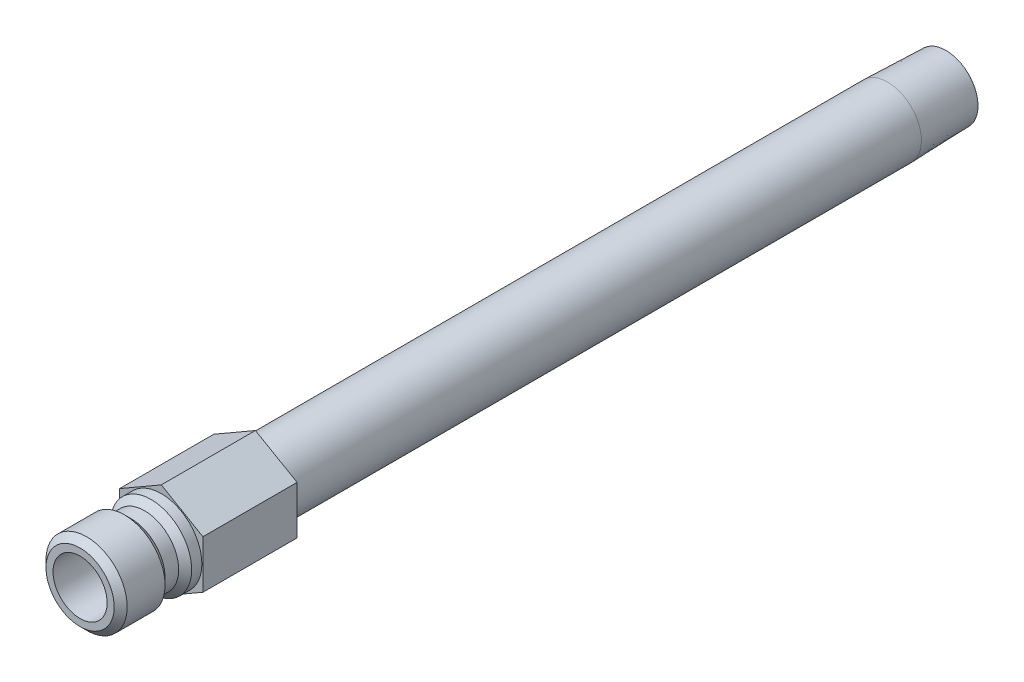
ISO-10303-21;
HEADER;
FILE_DESCRIPTION(('STEP AP214'),'2;1');
FILE_NAME('part.step','',(''),(''),'','','');
FILE_SCHEMA(('AUTOMOTIVE_DESIGN { 1 0 10303 214 1 1 1 1 }'));
ENDSEC;
DATA;
#1=APPLICATION_CONTEXT('core data for automotive mechanical design processes');
#2=APPLICATION_PROTOCOL_DEFINITION('international standard','automotive_design',2000,#1);
#3=PRODUCT_CONTEXT('',#1,'mechanical');
#4=PRODUCT('Part','Part','',(#3));
#5=PRODUCT_RELATED_PRODUCT_CATEGORY('part','',(#4));
#6=PRODUCT_DEFINITION_FORMATION('','',#4);
#7=PRODUCT_DEFINITION_CONTEXT('part definition',#1,'design');
#8=PRODUCT_DEFINITION('design','',#6,#7);
#9=PRODUCT_DEFINITION_SHAPE('','',#8);
#10=(LENGTH_UNIT() NAMED_UNIT(*) SI_UNIT(.MILLI.,.METRE.));
#11=(NAMED_UNIT(*) PLANE_ANGLE_UNIT() SI_UNIT($,.RADIAN.));
#12=(NAMED_UNIT(*) SI_UNIT($,.STERADIAN.) SOLID_ANGLE_UNIT());
#13=UNCERTAINTY_MEASURE_WITH_UNIT(LENGTH_MEASURE(1.E-05),#10,'distance_accuracy_value','');
#14=(GEOMETRIC_REPRESENTATION_CONTEXT(3) GLOBAL_UNCERTAINTY_ASSIGNED_CONTEXT((#13)) GLOBAL_UNIT_ASSIGNED_CONTEXT((#10,
#11,#12)) REPRESENTATION_CONTEXT('',''));
#15=CARTESIAN_POINT('',(0.,0.,0.));
#16=DIRECTION('',(0.,0.,1.));
#17=DIRECTION('',(1.,0.,0.));
#18=AXIS2_PLACEMENT_3D('',#15,#16,#17);
#19=CARTESIAN_POINT('',(0.,0.,0.));
#20=DIRECTION('',(0.,0.,-1.));
#21=DIRECTION('',(0.,1.,0.));
#22=AXIS2_PLACEMENT_3D('',#19,#20,#21);
#23=CYLINDRICAL_SURFACE('',#22,3.175);
#24=CARTESIAN_POINT('',(0.,0.,0.));
#25=DIRECTION('',(0.,0.,1.));
#26=DIRECTION('',(1.,0.,0.));
#27=AXIS2_PLACEMENT_3D('',#24,#25,#26);
#28=CIRCLE('',#27,3.175);
#29=CARTESIAN_POINT('',(3.175,0.,0.));
#30=VERTEX_POINT('',#29);
#31=EDGE_CURVE('E11',#30,#30,#28,.T.);
#32=ORIENTED_EDGE('',*,*,#31,.F.);
#33=EDGE_LOOP('',(#32));
#34=FACE_BOUND('',#33,.T.);
#35=CARTESIAN_POINT('',(0.,0.,9.525));
#36=DIRECTION('',(0.,0.,-1.));
#37=DIRECTION('',(0.,1.,0.));
#38=AXIS2_PLACEMENT_3D('',#35,#36,#37);
#39=CIRCLE('',#38,3.175);
#40=CARTESIAN_POINT('',(0.,3.175,9.525));
#41=VERTEX_POINT('',#40);
#42=EDGE_CURVE('E37',#41,#41,#39,.T.);
#43=ORIENTED_EDGE('',*,*,#42,.F.);
#44=EDGE_LOOP('',(#43));
#45=FACE_BOUND('',#44,.T.);
#46=ADVANCED_FACE('F34',(#34,#45),#23,.F.);
#47=CARTESIAN_POINT('',(0.,3.175,9.525));
#48=DIRECTION('',(0.,0.,1.));
#49=DIRECTION('',(0.,-1.,0.));
#50=AXIS2_PLACEMENT_3D('',#47,#48,#49);
#51=PLANE('',#50);
#52=ORIENTED_EDGE('',*,*,#42,.T.);
#53=EDGE_LOOP('',(#52));
#54=FACE_BOUND('',#53,.T.);
#55=CARTESIAN_POINT('',(0.,0.,9.525));
#56=DIRECTION('',(0.,0.,-1.));
#57=DIRECTION('',(0.,1.,0.));
#58=AXIS2_PLACEMENT_3D('',#55,#56,#57);
#59=CIRCLE('',#58,4.0005);
#60=CARTESIAN_POINT('',(0.,4.0005,9.525));
#61=VERTEX_POINT('',#60);
#62=EDGE_CURVE('E174',#61,#61,#59,.T.);
#63=ORIENTED_EDGE('',*,*,#62,.F.);
#64=EDGE_LOOP('',(#63));
#65=FACE_BOUND('',#64,.T.);
#66=ADVANCED_FACE('F181',(#54,#65),#51,.T.);
#67=CARTESIAN_POINT('',(0.,0.,8.763));
#68=DIRECTION('',(0.,0.,-1.));
#69=DIRECTION('',(0.,1.,0.));
#70=AXIS2_PLACEMENT_3D('',#67,#68,#69);
#71=CONICAL_SURFACE('',#70,4.7625,0.785398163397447);
#72=ORIENTED_EDGE('',*,*,#62,.T.);
#73=EDGE_LOOP('',(#72));
#74=FACE_BOUND('',#73,.T.);
#75=CARTESIAN_POINT('',(0.,0.,8.763));
#76=DIRECTION('',(0.,0.,-1.));
#77=DIRECTION('',(0.,1.,0.));
#78=AXIS2_PLACEMENT_3D('',#75,#76,#77);
#79=CIRCLE('',#78,4.7625);
#80=CARTESIAN_POINT('',(0.,4.7625,8.763));
#81=VERTEX_POINT('',#80);
#82=EDGE_CURVE('E172',#81,#81,#79,.T.);
#83=ORIENTED_EDGE('',*,*,#82,.F.);
#84=EDGE_LOOP('',(#83));
#85=FACE_BOUND('',#84,.T.);
#86=ADVANCED_FACE('F189',(#74,#85),#71,.T.);
#87=CARTESIAN_POINT('',(0.,0.,0.));
#88=DIRECTION('',(0.,0.,-1.));
#89=DIRECTION('',(0.,1.,0.));
#90=AXIS2_PLACEMENT_3D('',#87,#88,#89);
#91=CYLINDRICAL_SURFACE('',#90,4.7625);
#92=ORIENTED_EDGE('',*,*,#82,.T.);
#93=EDGE_LOOP('',(#92));
#94=FACE_BOUND('',#93,.T.);
#95=CARTESIAN_POINT('',(0.,0.,4.318));
#96=DIRECTION('',(0.,0.,-1.));
#97=DIRECTION('',(0.,1.,0.));
#98=AXIS2_PLACEMENT_3D('',#95,#96,#97);
#99=CIRCLE('',#98,4.7625);
#100=CARTESIAN_POINT('',(0.,4.7625,4.318));
#101=VERTEX_POINT('',#100);
#102=EDGE_CURVE('E169',#101,#101,#99,.T.);
#103=ORIENTED_EDGE('',*,*,#102,.F.);
#104=EDGE_LOOP('',(#103));
#105=FACE_BOUND('',#104,.T.);
#106=ADVANCED_FACE('F255',(#94,#105),#91,.T.);
#107=CARTESIAN_POINT('',(0.,0.,3.556));
#108=DIRECTION('',(0.,0.,1.));
#109=DIRECTION('',(0.,-1.,0.));
#110=AXIS2_PLACEMENT_3D('',#107,#108,#109);
#111=CONICAL_SURFACE('',#110,4.0005,0.785398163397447);
#112=ORIENTED_EDGE('',*,*,#102,.T.);
#113=EDGE_LOOP('',(#112));
#114=FACE_BOUND('',#113,.T.);
#115=CARTESIAN_POINT('',(0.,0.,3.556));
#116=DIRECTION('',(0.,0.,-1.));
#117=DIRECTION('',(0.,1.,0.));
#118=AXIS2_PLACEMENT_3D('',#115,#116,#117);
#119=CIRCLE('',#118,4.0005);
#120=CARTESIAN_POINT('',(0.,4.0005,3.556));
#121=VERTEX_POINT('',#120);
#122=EDGE_CURVE('E166',#121,#121,#119,.T.);
#123=ORIENTED_EDGE('',*,*,#122,.F.);
#124=EDGE_LOOP('',(#123));
#125=FACE_BOUND('',#124,.T.);
#126=ADVANCED_FACE('F251',(#114,#125),#111,.T.);
#127=CARTESIAN_POINT('',(0.,0.,0.));
#128=DIRECTION('',(0.,0.,-1.));
#129=DIRECTION('',(0.,1.,0.));
#130=AXIS2_PLACEMENT_3D('',#127,#128,#129);
#131=CYLINDRICAL_SURFACE('',#130,4.0005);
#132=ORIENTED_EDGE('',*,*,#122,.T.);
#133=EDGE_LOOP('',(#132));
#134=FACE_BOUND('',#133,.T.);
#135=CARTESIAN_POINT('',(0.,0.,1.9558));
#136=DIRECTION('',(0.,0.,-1.));
#137=DIRECTION('',(0.,1.,0.));
#138=AXIS2_PLACEMENT_3D('',#135,#136,#137);
#139=CIRCLE('',#138,4.0005);
#140=CARTESIAN_POINT('',(0.,4.0005,1.9558));
#141=VERTEX_POINT('',#140);
#142=EDGE_CURVE('E163',#141,#141,#139,.T.);
#143=ORIENTED_EDGE('',*,*,#142,.F.);
#144=EDGE_LOOP('',(#143));
#145=FACE_BOUND('',#144,.T.);
#146=ADVANCED_FACE('F247',(#134,#145),#131,.T.);
#147=CARTESIAN_POINT('',(0.,0.,1.1938));
#148=DIRECTION('',(0.,0.,-1.));
#149=DIRECTION('',(0.,1.,0.));
#150=AXIS2_PLACEMENT_3D('',#147,#148,#149);
#151=CONICAL_SURFACE('',#150,4.7625,0.785398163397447);
#152=ORIENTED_EDGE('',*,*,#142,.T.);
#153=EDGE_LOOP('',(#152));
#154=FACE_BOUND('',#153,.T.);
#155=CARTESIAN_POINT('',(0.,0.,1.1938));
#156=DIRECTION('',(0.,0.,-1.));
#157=DIRECTION('',(0.,1.,0.));
#158=AXIS2_PLACEMENT_3D('',#155,#156,#157);
#159=CIRCLE('',#158,4.7625);
#160=CARTESIAN_POINT('',(0.,4.7625,1.1938));
#161=VERTEX_POINT('',#160);
#162=EDGE_CURVE('E160',#161,#161,#159,.T.);
#163=ORIENTED_EDGE('',*,*,#162,.F.);
#164=EDGE_LOOP('',(#163));
#165=FACE_BOUND('',#164,.T.);
#166=ADVANCED_FACE('F243',(#154,#165),#151,.T.);
#167=CARTESIAN_POINT('',(0.,0.,0.));
#168=DIRECTION('',(0.,0.,-1.));
#169=DIRECTION('',(0.,1.,0.));
#170=AXIS2_PLACEMENT_3D('',#167,#168,#169);
#171=CYLINDRICAL_SURFACE('',#170,4.7625);
#172=ORIENTED_EDGE('',*,*,#162,.T.);
#173=EDGE_LOOP('',(#172));
#174=FACE_BOUND('',#173,.T.);
#175=CARTESIAN_POINT('',(0.,0.,0.));
#176=DIRECTION('',(0.,0.,-1.));
#177=DIRECTION('',(0.,1.,0.));
#178=AXIS2_PLACEMENT_3D('',#175,#176,#177);
#179=CIRCLE('',#178,4.7625);
#180=CARTESIAN_POINT('',(0.,4.7625,0.));
#181=VERTEX_POINT('',#180);
#182=EDGE_CURVE('E157',#181,#181,#179,.T.);
#183=ORIENTED_EDGE('',*,*,#182,.F.);
#184=EDGE_LOOP('',(#183));
#185=FACE_BOUND('',#184,.T.);
#186=ADVANCED_FACE('F196',(#174,#185),#171,.T.);
#187=CARTESIAN_POINT('',(-4.8895,2.82295414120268,0.));
#188=DIRECTION('',(0.,0.,1.));
#189=DIRECTION('',(1.,0.,0.));
#190=AXIS2_PLACEMENT_3D('',#187,#188,#189);
#191=PLANE('',#190);
#192=ORIENTED_EDGE('',*,*,#31,.T.);
#193=EDGE_LOOP('',(#192));
#194=FACE_BOUND('',#193,.T.);
#195=CARTESIAN_POINT('',(0.,0.,0.));
#196=DIRECTION('',(0.,0.,1.));
#197=DIRECTION('',(1.,0.,0.));
#198=AXIS2_PLACEMENT_3D('',#195,#196,#197);
#199=CIRCLE('',#198,2.38124999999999);
#200=CARTESIAN_POINT('',(2.38124999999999,0.,0.));
#201=VERTEX_POINT('',#200);
#202=EDGE_CURVE('E126',#201,#201,#199,.T.);
#203=ORIENTED_EDGE('',*,*,#202,.F.);
#204=EDGE_LOOP('',(#203));
#205=FACE_BOUND('',#204,.T.);
#206=ADVANCED_FACE('F192',(#194,#205),#191,.T.);
#207=CARTESIAN_POINT('',(0.,0.,-92.075));
#208=DIRECTION('',(0.,0.,1.));
#209=DIRECTION('',(0.,-1.,0.));
#210=AXIS2_PLACEMENT_3D('',#207,#208,#209);
#211=CONICAL_SURFACE('',#210,3.75443877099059,0.0312396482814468);
#212=CARTESIAN_POINT('',(0.,0.,-85.217));
#213=DIRECTION('',(0.,0.,-1.));
#214=DIRECTION('',(0.,1.,0.));
#215=AXIS2_PLACEMENT_3D('',#212,#213,#214);
#216=CIRCLE('',#215,3.96874999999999);
#217=CARTESIAN_POINT('',(0.,3.96875,-85.217));
#218=VERTEX_POINT('',#217);
#219=EDGE_CURVE('E154',#218,#218,#216,.T.);
#220=ORIENTED_EDGE('',*,*,#219,.T.);
#221=EDGE_LOOP('',(#220));
#222=FACE_BOUND('',#221,.T.);
#223=CARTESIAN_POINT('',(0.,0.,-92.075));
#224=DIRECTION('',(0.,0.,-1.));
#225=DIRECTION('',(0.,1.,0.));
#226=AXIS2_PLACEMENT_3D('',#223,#224,#225);
#227=CIRCLE('',#226,3.75443877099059);
#228=CARTESIAN_POINT('',(0.,3.7544387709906,-92.075));
#229=VERTEX_POINT('',#228);
#230=EDGE_CURVE('E151',#229,#229,#227,.T.);
#231=ORIENTED_EDGE('',*,*,#230,.F.);
#232=EDGE_LOOP('',(#231));
#233=FACE_BOUND('',#232,.T.);
#234=ADVANCED_FACE('F195',(#222,#233),#211,.T.);
#235=CARTESIAN_POINT('',(0.,0.,0.));
#236=DIRECTION('',(0.,0.,-1.));
#237=DIRECTION('',(0.,1.,0.));
#238=AXIS2_PLACEMENT_3D('',#235,#236,#237);
#239=CYLINDRICAL_SURFACE('',#238,3.96874999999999);
#240=ORIENTED_EDGE('',*,*,#219,.F.);
#241=EDGE_LOOP('',(#240));
#242=FACE_BOUND('',#241,.T.);
#243=CARTESIAN_POINT('',(0.,0.,-11.049));
#244=DIRECTION('',(0.,0.,1.));
#245=DIRECTION('',(1.,0.,0.));
#246=AXIS2_PLACEMENT_3D('',#243,#244,#245);
#247=CIRCLE('',#246,3.96874999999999);
#248=CARTESIAN_POINT('',(3.96874999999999,0.,-11.049));
#249=VERTEX_POINT('',#248);
#250=EDGE_CURVE('E140',#249,#249,#247,.F.);
#251=ORIENTED_EDGE('',*,*,#250,.T.);
#252=EDGE_LOOP('',(#251));
#253=FACE_BOUND('',#252,.T.);
#254=ADVANCED_FACE('F233',(#242,#253),#239,.T.);
#255=CARTESIAN_POINT('',(0.,3.7544387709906,-92.075));
#256=DIRECTION('',(0.,0.,-1.));
#257=DIRECTION('',(0.,1.,0.));
#258=AXIS2_PLACEMENT_3D('',#255,#256,#257);
#259=PLANE('',#258);
#260=ORIENTED_EDGE('',*,*,#230,.T.);
#261=EDGE_LOOP('',(#260));
#262=FACE_BOUND('',#261,.T.);
#263=CARTESIAN_POINT('',(0.,0.,-92.075));
#264=DIRECTION('',(0.,0.,-1.));
#265=DIRECTION('',(0.,1.,0.));
#266=AXIS2_PLACEMENT_3D('',#263,#264,#265);
#267=CIRCLE('',#266,2.38124999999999);
#268=CARTESIAN_POINT('',(0.,2.38125,-92.075));
#269=VERTEX_POINT('',#268);
#270=EDGE_CURVE('E147',#269,#269,#267,.T.);
#271=ORIENTED_EDGE('',*,*,#270,.F.);
#272=EDGE_LOOP('',(#271));
#273=FACE_BOUND('',#272,.T.);
#274=ADVANCED_FACE('F230',(#262,#273),#259,.T.);
#275=CARTESIAN_POINT('',(0.,0.,0.));
#276=DIRECTION('',(0.,0.,-1.));
#277=DIRECTION('',(0.,1.,0.));
#278=AXIS2_PLACEMENT_3D('',#275,#276,#277);
#279=CYLINDRICAL_SURFACE('',#278,2.38124999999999);
#280=ORIENTED_EDGE('',*,*,#202,.T.);
#281=EDGE_LOOP('',(#280));
#282=FACE_BOUND('',#281,.T.);
#283=ORIENTED_EDGE('',*,*,#270,.T.);
#284=EDGE_LOOP('',(#283));
#285=FACE_BOUND('',#284,.T.);
#286=ADVANCED_FACE('F216',(#282,#285),#279,.F.);
#287=CARTESIAN_POINT('',(0.,5.64590828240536,-11.049));
#288=DIRECTION('',(-0.5,0.866025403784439,0.));
#289=DIRECTION('',(-0.866025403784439,-0.5,0.));
#290=AXIS2_PLACEMENT_3D('',#287,#288,#289);
#291=PLANE('',#290);
#292=DIRECTION('',(-0.866025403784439,-0.5,0.));
#293=VECTOR('',#292,1.);
#294=CARTESIAN_POINT('',(0.,5.64590828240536,0.));
#295=LINE('',#294,#293);
#296=CARTESIAN_POINT('',(0.,5.64590828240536,0.));
#297=VERTEX_POINT('',#296);
#298=CARTESIAN_POINT('',(-4.8895,2.82295414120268,0.));
#299=VERTEX_POINT('',#298);
#300=EDGE_CURVE('E122',#297,#299,#295,.T.);
#301=ORIENTED_EDGE('',*,*,#300,.F.);
#302=DIRECTION('',(0.,0.,1.));
#303=VECTOR('',#302,1.);
#304=CARTESIAN_POINT('',(0.,5.64590828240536,-11.049));
#305=LINE('',#304,#303);
#306=CARTESIAN_POINT('',(0.,5.64590828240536,-11.049));
#307=VERTEX_POINT('',#306);
#308=EDGE_CURVE('E51',#307,#297,#305,.T.);
#309=ORIENTED_EDGE('',*,*,#308,.F.);
#310=DIRECTION('',(-0.866025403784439,-0.5,0.));
#311=VECTOR('',#310,1.);
#312=CARTESIAN_POINT('',(0.,5.64590828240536,-11.049));
#313=LINE('',#312,#311);
#314=CARTESIAN_POINT('',(-4.8895,2.82295414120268,-11.049));
#315=VERTEX_POINT('',#314);
#316=EDGE_CURVE('E138',#307,#315,#313,.T.);
#317=ORIENTED_EDGE('',*,*,#316,.T.);
#318=DIRECTION('',(0.,0.,1.));
#319=VECTOR('',#318,1.);
#320=CARTESIAN_POINT('',(-4.8895,2.82295414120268,-11.049));
#321=LINE('',#320,#319);
#322=EDGE_CURVE('E86',#315,#299,#321,.T.);
#323=ORIENTED_EDGE('',*,*,#322,.T.);
#324=EDGE_LOOP('',(#301,#309,#317,#323));
#325=FACE_BOUND('',#324,.T.);
#326=ADVANCED_FACE('F206',(#325),#291,.T.);
#327=CARTESIAN_POINT('',(4.8895,2.82295414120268,-11.049));
#328=DIRECTION('',(0.5,0.866025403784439,0.));
#329=DIRECTION('',(-0.866025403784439,0.5,0.));
#330=AXIS2_PLACEMENT_3D('',#327,#328,#329);
#331=PLANE('',#330);
#332=DIRECTION('',(-0.866025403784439,0.5,0.));
#333=VECTOR('',#332,1.);
#334=CARTESIAN_POINT('',(4.8895,2.82295414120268,0.));
#335=LINE('',#334,#333);
#336=CARTESIAN_POINT('',(4.8895,2.82295414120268,0.));
#337=VERTEX_POINT('',#336);
#338=EDGE_CURVE('E135',#337,#297,#335,.T.);
#339=ORIENTED_EDGE('',*,*,#338,.F.);
#340=DIRECTION('',(0.,0.,1.));
#341=VECTOR('',#340,1.);
#342=CARTESIAN_POINT('',(4.8895,2.82295414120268,-11.049));
#343=LINE('',#342,#341);
#344=CARTESIAN_POINT('',(4.8895,2.82295414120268,-11.049));
#345=VERTEX_POINT('',#344);
#346=EDGE_CURVE('E74',#345,#337,#343,.T.);
#347=ORIENTED_EDGE('',*,*,#346,.F.);
#348=DIRECTION('',(-0.866025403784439,0.5,0.));
#349=VECTOR('',#348,1.);
#350=CARTESIAN_POINT('',(4.8895,2.82295414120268,-11.049));
#351=LINE('',#350,#349);
#352=EDGE_CURVE('E112',#345,#307,#351,.T.);
#353=ORIENTED_EDGE('',*,*,#352,.T.);
#354=ORIENTED_EDGE('',*,*,#308,.T.);
#355=EDGE_LOOP('',(#339,#347,#353,#354));
#356=FACE_BOUND('',#355,.T.);
#357=ADVANCED_FACE('F208',(#356),#331,.T.);
#358=CARTESIAN_POINT('',(4.8895,-2.82295414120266,-11.049));
#359=DIRECTION('',(1.,0.,0.));
#360=DIRECTION('',(0.,0.,-1.));
#361=AXIS2_PLACEMENT_3D('',#358,#359,#360);
#362=PLANE('',#361);
#363=DIRECTION('',(0.,1.,0.));
#364=VECTOR('',#363,1.);
#365=CARTESIAN_POINT('',(4.8895,-2.82295414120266,0.));
#366=LINE('',#365,#364);
#367=CARTESIAN_POINT('',(4.8895,-2.82295414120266,0.));
#368=VERTEX_POINT('',#367);
#369=EDGE_CURVE('E99',#368,#337,#366,.T.);
#370=ORIENTED_EDGE('',*,*,#369,.F.);
#371=DIRECTION('',(0.,0.,1.));
#372=VECTOR('',#371,1.);
#373=CARTESIAN_POINT('',(4.8895,-2.82295414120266,-11.049));
#374=LINE('',#373,#372);
#375=CARTESIAN_POINT('',(4.8895,-2.82295414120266,-11.049));
#376=VERTEX_POINT('',#375);
#377=EDGE_CURVE('E94',#376,#368,#374,.T.);
#378=ORIENTED_EDGE('',*,*,#377,.F.);
#379=DIRECTION('',(0.,1.,0.));
#380=VECTOR('',#379,1.);
#381=CARTESIAN_POINT('',(4.8895,-2.82295414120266,-11.049));
#382=LINE('',#381,#380);
#383=EDGE_CURVE('E97',#376,#345,#382,.T.);
#384=ORIENTED_EDGE('',*,*,#383,.T.);
#385=ORIENTED_EDGE('',*,*,#346,.T.);
#386=EDGE_LOOP('',(#370,#378,#384,#385));
#387=FACE_BOUND('',#386,.T.);
#388=ADVANCED_FACE('F96',(#387),#362,.T.);
#389=CARTESIAN_POINT('',(0.,-5.64590828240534,-11.049));
#390=DIRECTION('',(0.5,-0.866025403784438,0.));
#391=DIRECTION('',(0.866025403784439,0.5,0.));
#392=AXIS2_PLACEMENT_3D('',#389,#390,#391);
#393=PLANE('',#392);
#394=DIRECTION('',(0.866025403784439,0.5,0.));
#395=VECTOR('',#394,1.);
#396=CARTESIAN_POINT('',(0.,-5.64590828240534,0.));
#397=LINE('',#396,#395);
#398=CARTESIAN_POINT('',(0.,-5.64590828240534,0.));
#399=VERTEX_POINT('',#398);
#400=EDGE_CURVE('E132',#399,#368,#397,.T.);
#401=ORIENTED_EDGE('',*,*,#400,.F.);
#402=DIRECTION('',(0.,0.,1.));
#403=VECTOR('',#402,1.);
#404=CARTESIAN_POINT('',(0.,-5.64590828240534,-11.049));
#405=LINE('',#404,#403);
#406=CARTESIAN_POINT('',(0.,-5.64590828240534,-11.049));
#407=VERTEX_POINT('',#406);
#408=EDGE_CURVE('E104',#407,#399,#405,.T.);
#409=ORIENTED_EDGE('',*,*,#408,.F.);
#410=DIRECTION('',(0.866025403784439,0.5,0.));
#411=VECTOR('',#410,1.);
#412=CARTESIAN_POINT('',(0.,-5.64590828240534,-11.049));
#413=LINE('',#412,#411);
#414=EDGE_CURVE('E110',#407,#376,#413,.T.);
#415=ORIENTED_EDGE('',*,*,#414,.T.);
#416=ORIENTED_EDGE('',*,*,#377,.T.);
#417=EDGE_LOOP('',(#401,#409,#415,#416));
#418=FACE_BOUND('',#417,.T.);
#419=ADVANCED_FACE('F114',(#418),#393,.T.);
#420=CARTESIAN_POINT('',(-4.8895,-2.82295414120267,-11.049));
#421=DIRECTION('',(-0.5,-0.866025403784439,0.));
#422=DIRECTION('',(0.866025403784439,-0.5,0.));
#423=AXIS2_PLACEMENT_3D('',#420,#421,#422);
#424=PLANE('',#423);
#425=DIRECTION('',(0.866025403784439,-0.5,0.));
#426=VECTOR('',#425,1.);
#427=CARTESIAN_POINT('',(-4.8895,-2.82295414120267,0.));
#428=LINE('',#427,#426);
#429=CARTESIAN_POINT('',(-4.8895,-2.82295414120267,0.));
#430=VERTEX_POINT('',#429);
#431=EDGE_CURVE('E129',#430,#399,#428,.T.);
#432=ORIENTED_EDGE('',*,*,#431,.F.);
#433=DIRECTION('',(0.,0.,1.));
#434=VECTOR('',#433,1.);
#435=CARTESIAN_POINT('',(-4.8895,-2.82295414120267,-11.049));
#436=LINE('',#435,#434);
#437=CARTESIAN_POINT('',(-4.8895,-2.82295414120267,-11.049));
#438=VERTEX_POINT('',#437);
#439=EDGE_CURVE('E143',#438,#430,#436,.T.);
#440=ORIENTED_EDGE('',*,*,#439,.F.);
#441=DIRECTION('',(0.866025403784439,-0.5,0.));
#442=VECTOR('',#441,1.);
#443=CARTESIAN_POINT('',(-4.8895,-2.82295414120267,-11.049));
#444=LINE('',#443,#442);
#445=EDGE_CURVE('E115',#438,#407,#444,.T.);
#446=ORIENTED_EDGE('',*,*,#445,.T.);
#447=ORIENTED_EDGE('',*,*,#408,.T.);
#448=EDGE_LOOP('',(#432,#440,#446,#447));
#449=FACE_BOUND('',#448,.T.);
#450=ADVANCED_FACE('F222',(#449),#424,.T.);
#451=CARTESIAN_POINT('',(-4.8895,2.82295414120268,-11.049));
#452=DIRECTION('',(-1.,0.,0.));
#453=DIRECTION('',(0.,0.,1.));
#454=AXIS2_PLACEMENT_3D('',#451,#452,#453);
#455=PLANE('',#454);
#456=DIRECTION('',(0.,-1.,0.));
#457=VECTOR('',#456,1.);
#458=CARTESIAN_POINT('',(-4.8895,2.82295414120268,0.));
#459=LINE('',#458,#457);
#460=EDGE_CURVE('E125',#299,#430,#459,.T.);
#461=ORIENTED_EDGE('',*,*,#460,.F.);
#462=ORIENTED_EDGE('',*,*,#322,.F.);
#463=DIRECTION('',(0.,-1.,0.));
#464=VECTOR('',#463,1.);
#465=CARTESIAN_POINT('',(-4.8895,2.82295414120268,-11.049));
#466=LINE('',#465,#464);
#467=EDGE_CURVE('E117',#315,#438,#466,.T.);
#468=ORIENTED_EDGE('',*,*,#467,.T.);
#469=ORIENTED_EDGE('',*,*,#439,.T.);
#470=EDGE_LOOP('',(#461,#462,#468,#469));
#471=FACE_BOUND('',#470,.T.);
#472=ADVANCED_FACE('F204',(#471),#455,.T.);
#473=CARTESIAN_POINT('',(-4.8895,2.82295414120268,-11.049));
#474=DIRECTION('',(0.,0.,1.));
#475=DIRECTION('',(1.,0.,0.));
#476=AXIS2_PLACEMENT_3D('',#473,#474,#475);
#477=PLANE('',#476);
#478=ORIENTED_EDGE('',*,*,#250,.F.);
#479=EDGE_LOOP('',(#478));
#480=FACE_BOUND('',#479,.T.);
#481=ORIENTED_EDGE('',*,*,#316,.F.);
#482=ORIENTED_EDGE('',*,*,#352,.F.);
#483=ORIENTED_EDGE('',*,*,#383,.F.);
#484=ORIENTED_EDGE('',*,*,#414,.F.);
#485=ORIENTED_EDGE('',*,*,#445,.F.);
#486=ORIENTED_EDGE('',*,*,#467,.F.);
#487=EDGE_LOOP('',(#481,#482,#483,#484,#485,#486));
#488=FACE_BOUND('',#487,.T.);
#489=ADVANCED_FACE('F108',(#480,#488),#477,.F.);
#490=ORIENTED_EDGE('',*,*,#182,.T.);
#491=EDGE_LOOP('',(#490));
#492=FACE_BOUND('',#491,.T.);
#493=ORIENTED_EDGE('',*,*,#300,.T.);
#494=ORIENTED_EDGE('',*,*,#460,.T.);
#495=ORIENTED_EDGE('',*,*,#431,.T.);
#496=ORIENTED_EDGE('',*,*,#400,.T.);
#497=ORIENTED_EDGE('',*,*,#369,.T.);
#498=ORIENTED_EDGE('',*,*,#338,.T.);
#499=EDGE_LOOP('',(#493,#494,#495,#496,#497,#498));
#500=FACE_BOUND('',#499,.T.);
#501=ADVANCED_FACE('F198',(#492,#500),#191,.T.);
#502=CLOSED_SHELL('',(#46,#66,#86,#106,#126,#146,#166,#186,#206,#234,#254,#274,#286,#326,#357,
#388,#419,#450,#472,#489,#501));
#503=MANIFOLD_SOLID_BREP('B2',#502);
#504=ADVANCED_BREP_SHAPE_REPRESENTATION('',(#18,#503),#14);
#505=SHAPE_DEFINITION_REPRESENTATION(#9,#504);
ENDSEC;
END-ISO-10303-21;
